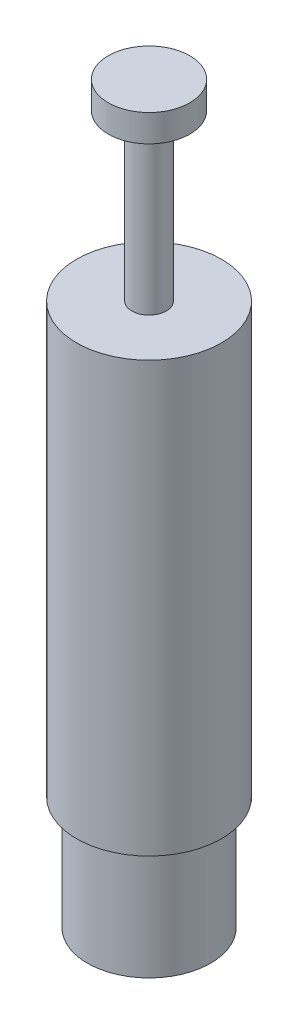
from build123d import *


with BuildPart() as part:
    # Sketch1 → Revolve1 (revolve)
    with BuildSketch(Plane.XY, mode=Mode.PRIVATE) as revolve1_sk:
        Polygon((0, 0), (3.4, 0), (3.4, 6.25), (4, 6.25), (4, 29.95), (0.95, 29.95), (0.95, 39.05), (2.25, 39.05), (2.25, 40.55), (0, 40.55), align=None)
    revolve(revolve1_sk.sketch.rotate(Axis((0, 0, 0), (0, 1, 0)), 90), axis=Axis((0, 0, 0), (0, 1, 0)))


solid = part.part
